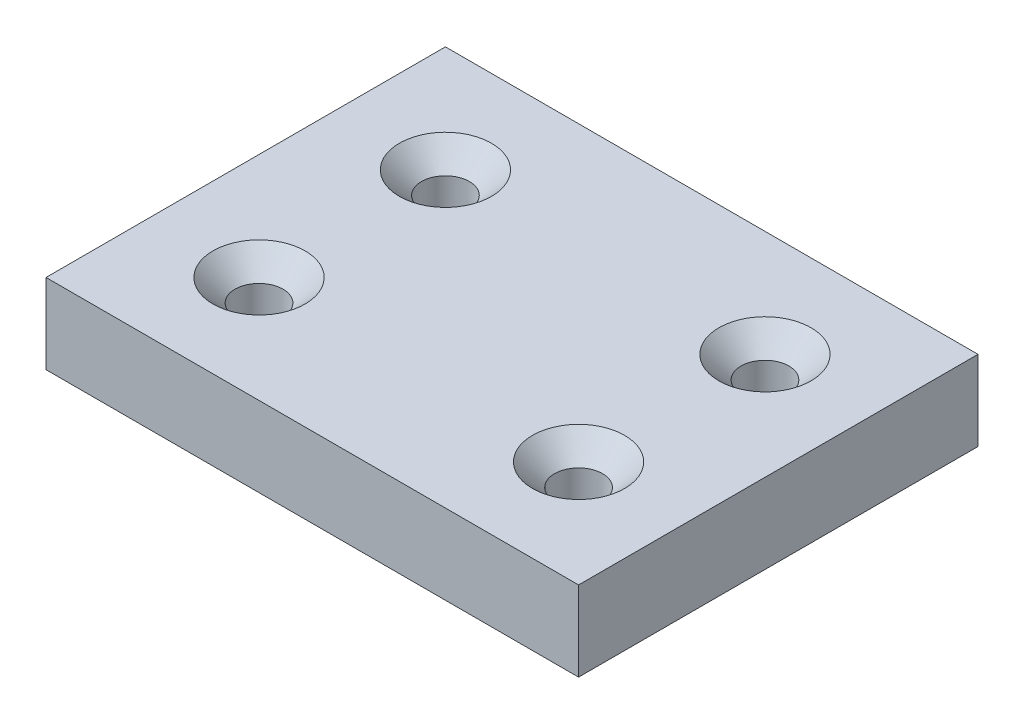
ISO-10303-21;
HEADER;
FILE_DESCRIPTION(('STEP AP214'),'2;1');
FILE_NAME('part.step','',(''),(''),'','','');
FILE_SCHEMA(('AUTOMOTIVE_DESIGN { 1 0 10303 214 1 1 1 1 }'));
ENDSEC;
DATA;
#1=APPLICATION_CONTEXT('core data for automotive mechanical design processes');
#2=APPLICATION_PROTOCOL_DEFINITION('international standard','automotive_design',2000,#1);
#3=PRODUCT_CONTEXT('',#1,'mechanical');
#4=PRODUCT('Part','Part','',(#3));
#5=PRODUCT_RELATED_PRODUCT_CATEGORY('part','',(#4));
#6=PRODUCT_DEFINITION_FORMATION('','',#4);
#7=PRODUCT_DEFINITION_CONTEXT('part definition',#1,'design');
#8=PRODUCT_DEFINITION('design','',#6,#7);
#9=PRODUCT_DEFINITION_SHAPE('','',#8);
#10=(LENGTH_UNIT() NAMED_UNIT(*) SI_UNIT(.MILLI.,.METRE.));
#11=(NAMED_UNIT(*) PLANE_ANGLE_UNIT() SI_UNIT($,.RADIAN.));
#12=(NAMED_UNIT(*) SI_UNIT($,.STERADIAN.) SOLID_ANGLE_UNIT());
#13=UNCERTAINTY_MEASURE_WITH_UNIT(LENGTH_MEASURE(1.E-05),#10,'distance_accuracy_value','');
#14=(GEOMETRIC_REPRESENTATION_CONTEXT(3) GLOBAL_UNCERTAINTY_ASSIGNED_CONTEXT((#13)) GLOBAL_UNIT_ASSIGNED_CONTEXT((#10,
#11,#12)) REPRESENTATION_CONTEXT('',''));
#15=CARTESIAN_POINT('',(0.,0.,0.));
#16=DIRECTION('',(0.,0.,1.));
#17=DIRECTION('',(1.,0.,0.));
#18=AXIS2_PLACEMENT_3D('',#15,#16,#17);
#19=CARTESIAN_POINT('',(50.,15.,37.5));
#20=DIRECTION('',(-1.,0.,0.));
#21=DIRECTION('',(0.,0.,1.));
#22=AXIS2_PLACEMENT_3D('',#19,#20,#21);
#23=PLANE('',#22);
#24=DIRECTION('',(0.,0.,-1.));
#25=VECTOR('',#24,1.);
#26=CARTESIAN_POINT('',(50.,0.,37.5));
#27=LINE('',#26,#25);
#28=CARTESIAN_POINT('',(50.,0.,37.5));
#29=VERTEX_POINT('',#28);
#30=CARTESIAN_POINT('',(50.,0.,-37.5));
#31=VERTEX_POINT('',#30);
#32=EDGE_CURVE('E97',#29,#31,#27,.T.);
#33=ORIENTED_EDGE('',*,*,#32,.T.);
#34=DIRECTION('',(0.,-1.,0.));
#35=VECTOR('',#34,1.);
#36=CARTESIAN_POINT('',(50.,15.,-37.5));
#37=LINE('',#36,#35);
#38=CARTESIAN_POINT('',(50.,15.,-37.5));
#39=VERTEX_POINT('',#38);
#40=EDGE_CURVE('E11',#39,#31,#37,.T.);
#41=ORIENTED_EDGE('',*,*,#40,.F.);
#42=DIRECTION('',(0.,0.,-1.));
#43=VECTOR('',#42,1.);
#44=CARTESIAN_POINT('',(50.,15.,37.5));
#45=LINE('',#44,#43);
#46=CARTESIAN_POINT('',(50.,15.,37.5));
#47=VERTEX_POINT('',#46);
#48=EDGE_CURVE('E85',#47,#39,#45,.T.);
#49=ORIENTED_EDGE('',*,*,#48,.F.);
#50=DIRECTION('',(0.,-1.,0.));
#51=VECTOR('',#50,1.);
#52=CARTESIAN_POINT('',(50.,15.,37.5));
#53=LINE('',#52,#51);
#54=EDGE_CURVE('E93',#47,#29,#53,.T.);
#55=ORIENTED_EDGE('',*,*,#54,.T.);
#56=EDGE_LOOP('',(#33,#41,#49,#55));
#57=FACE_BOUND('',#56,.T.);
#58=ADVANCED_FACE('F34',(#57),#23,.F.);
#59=CARTESIAN_POINT('',(-50.,15.,-37.5));
#60=DIRECTION('',(0.,0.,1.));
#61=DIRECTION('',(1.,0.,0.));
#62=AXIS2_PLACEMENT_3D('',#59,#60,#61);
#63=PLANE('',#62);
#64=DIRECTION('',(-1.,0.,0.));
#65=VECTOR('',#64,1.);
#66=CARTESIAN_POINT('',(-50.,0.,-37.5));
#67=LINE('',#66,#65);
#68=CARTESIAN_POINT('',(-50.,0.,-37.5));
#69=VERTEX_POINT('',#68);
#70=EDGE_CURVE('E89',#31,#69,#67,.T.);
#71=ORIENTED_EDGE('',*,*,#70,.T.);
#72=DIRECTION('',(0.,-1.,0.));
#73=VECTOR('',#72,1.);
#74=CARTESIAN_POINT('',(-50.,15.,-37.5));
#75=LINE('',#74,#73);
#76=CARTESIAN_POINT('',(-50.,15.,-37.5));
#77=VERTEX_POINT('',#76);
#78=EDGE_CURVE('E42',#77,#69,#75,.T.);
#79=ORIENTED_EDGE('',*,*,#78,.F.);
#80=DIRECTION('',(-1.,0.,0.));
#81=VECTOR('',#80,1.);
#82=CARTESIAN_POINT('',(-50.,15.,-37.5));
#83=LINE('',#82,#81);
#84=EDGE_CURVE('E80',#39,#77,#83,.T.);
#85=ORIENTED_EDGE('',*,*,#84,.F.);
#86=ORIENTED_EDGE('',*,*,#40,.T.);
#87=EDGE_LOOP('',(#71,#79,#85,#86));
#88=FACE_BOUND('',#87,.T.);
#89=ADVANCED_FACE('F88',(#88),#63,.F.);
#90=CARTESIAN_POINT('',(-50.,15.,37.5));
#91=DIRECTION('',(1.,0.,0.));
#92=DIRECTION('',(0.,0.,-1.));
#93=AXIS2_PLACEMENT_3D('',#90,#91,#92);
#94=PLANE('',#93);
#95=DIRECTION('',(0.,0.,1.));
#96=VECTOR('',#95,1.);
#97=CARTESIAN_POINT('',(-50.,0.,37.5));
#98=LINE('',#97,#96);
#99=CARTESIAN_POINT('',(-50.,0.,37.5));
#100=VERTEX_POINT('',#99);
#101=EDGE_CURVE('E67',#69,#100,#98,.T.);
#102=ORIENTED_EDGE('',*,*,#101,.T.);
#103=DIRECTION('',(0.,-1.,0.));
#104=VECTOR('',#103,1.);
#105=CARTESIAN_POINT('',(-50.,15.,37.5));
#106=LINE('',#105,#104);
#107=CARTESIAN_POINT('',(-50.,15.,37.5));
#108=VERTEX_POINT('',#107);
#109=EDGE_CURVE('E90',#108,#100,#106,.T.);
#110=ORIENTED_EDGE('',*,*,#109,.F.);
#111=DIRECTION('',(0.,0.,1.));
#112=VECTOR('',#111,1.);
#113=CARTESIAN_POINT('',(-50.,15.,37.5));
#114=LINE('',#113,#112);
#115=EDGE_CURVE('E83',#77,#108,#114,.T.);
#116=ORIENTED_EDGE('',*,*,#115,.F.);
#117=ORIENTED_EDGE('',*,*,#78,.T.);
#118=EDGE_LOOP('',(#102,#110,#116,#117));
#119=FACE_BOUND('',#118,.T.);
#120=ADVANCED_FACE('F91',(#119),#94,.F.);
#121=CARTESIAN_POINT('',(-50.,15.,37.5));
#122=DIRECTION('',(0.,0.,-1.));
#123=DIRECTION('',(-1.,0.,0.));
#124=AXIS2_PLACEMENT_3D('',#121,#122,#123);
#125=PLANE('',#124);
#126=DIRECTION('',(1.,0.,0.));
#127=VECTOR('',#126,1.);
#128=CARTESIAN_POINT('',(-50.,0.,37.5));
#129=LINE('',#128,#127);
#130=EDGE_CURVE('E73',#100,#29,#129,.T.);
#131=ORIENTED_EDGE('',*,*,#130,.T.);
#132=ORIENTED_EDGE('',*,*,#54,.F.);
#133=DIRECTION('',(1.,0.,0.));
#134=VECTOR('',#133,1.);
#135=CARTESIAN_POINT('',(-50.,15.,37.5));
#136=LINE('',#135,#134);
#137=EDGE_CURVE('E50',#108,#47,#136,.T.);
#138=ORIENTED_EDGE('',*,*,#137,.F.);
#139=ORIENTED_EDGE('',*,*,#109,.T.);
#140=EDGE_LOOP('',(#131,#132,#138,#139));
#141=FACE_BOUND('',#140,.T.);
#142=ADVANCED_FACE('F105',(#141),#125,.F.);
#143=CARTESIAN_POINT('',(0.,15.,0.));
#144=DIRECTION('',(0.,-1.,0.));
#145=DIRECTION('',(0.,0.,-1.));
#146=AXIS2_PLACEMENT_3D('',#143,#144,#145);
#147=PLANE('',#146);
#148=CARTESIAN_POINT('',(-30.,15.,17.5));
#149=DIRECTION('',(0.,1.,0.));
#150=DIRECTION('',(0.,0.,1.));
#151=AXIS2_PLACEMENT_3D('',#148,#149,#150);
#152=CIRCLE('',#151,8.65);
#153=CARTESIAN_POINT('',(-30.,15.,26.15));
#154=VERTEX_POINT('',#153);
#155=EDGE_CURVE('E143',#154,#154,#152,.T.);
#156=ORIENTED_EDGE('',*,*,#155,.F.);
#157=EDGE_LOOP('',(#156));
#158=FACE_BOUND('',#157,.T.);
#159=CARTESIAN_POINT('',(-30.,15.,-17.5));
#160=DIRECTION('',(0.,1.,0.));
#161=DIRECTION('',(0.,0.,1.));
#162=AXIS2_PLACEMENT_3D('',#159,#160,#161);
#163=CIRCLE('',#162,8.65);
#164=CARTESIAN_POINT('',(-30.,15.,-8.85));
#165=VERTEX_POINT('',#164);
#166=EDGE_CURVE('E134',#165,#165,#163,.T.);
#167=ORIENTED_EDGE('',*,*,#166,.F.);
#168=EDGE_LOOP('',(#167));
#169=FACE_BOUND('',#168,.T.);
#170=CARTESIAN_POINT('',(30.,15.,-17.5));
#171=DIRECTION('',(0.,1.,0.));
#172=DIRECTION('',(0.,0.,1.));
#173=AXIS2_PLACEMENT_3D('',#170,#171,#172);
#174=CIRCLE('',#173,8.65);
#175=CARTESIAN_POINT('',(30.,15.,-8.84999999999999));
#176=VERTEX_POINT('',#175);
#177=EDGE_CURVE('E125',#176,#176,#174,.T.);
#178=ORIENTED_EDGE('',*,*,#177,.F.);
#179=EDGE_LOOP('',(#178));
#180=FACE_BOUND('',#179,.T.);
#181=CARTESIAN_POINT('',(30.,15.,17.5));
#182=DIRECTION('',(0.,1.,0.));
#183=DIRECTION('',(0.,0.,1.));
#184=AXIS2_PLACEMENT_3D('',#181,#182,#183);
#185=CIRCLE('',#184,8.65);
#186=CARTESIAN_POINT('',(30.,15.,26.15));
#187=VERTEX_POINT('',#186);
#188=EDGE_CURVE('E116',#187,#187,#185,.T.);
#189=ORIENTED_EDGE('',*,*,#188,.F.);
#190=EDGE_LOOP('',(#189));
#191=FACE_BOUND('',#190,.T.);
#192=ORIENTED_EDGE('',*,*,#48,.T.);
#193=ORIENTED_EDGE('',*,*,#84,.T.);
#194=ORIENTED_EDGE('',*,*,#115,.T.);
#195=ORIENTED_EDGE('',*,*,#137,.T.);
#196=EDGE_LOOP('',(#192,#193,#194,#195));
#197=FACE_BOUND('',#196,.T.);
#198=ADVANCED_FACE('F81',(#158,#169,#180,#191,#197),#147,.F.);
#199=CARTESIAN_POINT('',(0.,0.,0.));
#200=DIRECTION('',(0.,-1.,0.));
#201=DIRECTION('',(0.,0.,-1.));
#202=AXIS2_PLACEMENT_3D('',#199,#200,#201);
#203=PLANE('',#202);
#204=CARTESIAN_POINT('',(-30.,0.,17.5));
#205=DIRECTION('',(0.,1.,0.));
#206=DIRECTION('',(0.,0.,1.));
#207=AXIS2_PLACEMENT_3D('',#204,#205,#206);
#208=CIRCLE('',#207,4.5);
#209=CARTESIAN_POINT('',(-30.,0.,22.));
#210=VERTEX_POINT('',#209);
#211=EDGE_CURVE('E137',#210,#210,#208,.T.);
#212=ORIENTED_EDGE('',*,*,#211,.T.);
#213=EDGE_LOOP('',(#212));
#214=FACE_BOUND('',#213,.T.);
#215=CARTESIAN_POINT('',(-30.,0.,-17.5));
#216=DIRECTION('',(0.,1.,0.));
#217=DIRECTION('',(0.,0.,1.));
#218=AXIS2_PLACEMENT_3D('',#215,#216,#217);
#219=CIRCLE('',#218,4.5);
#220=CARTESIAN_POINT('',(-30.,0.,-13.));
#221=VERTEX_POINT('',#220);
#222=EDGE_CURVE('E128',#221,#221,#219,.T.);
#223=ORIENTED_EDGE('',*,*,#222,.T.);
#224=EDGE_LOOP('',(#223));
#225=FACE_BOUND('',#224,.T.);
#226=CARTESIAN_POINT('',(30.,0.,-17.5));
#227=DIRECTION('',(0.,1.,0.));
#228=DIRECTION('',(0.,0.,1.));
#229=AXIS2_PLACEMENT_3D('',#226,#227,#228);
#230=CIRCLE('',#229,4.49999999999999);
#231=CARTESIAN_POINT('',(30.,0.,-13.));
#232=VERTEX_POINT('',#231);
#233=EDGE_CURVE('E119',#232,#232,#230,.T.);
#234=ORIENTED_EDGE('',*,*,#233,.T.);
#235=EDGE_LOOP('',(#234));
#236=FACE_BOUND('',#235,.T.);
#237=CARTESIAN_POINT('',(30.,0.,17.5));
#238=DIRECTION('',(0.,1.,0.));
#239=DIRECTION('',(0.,0.,1.));
#240=AXIS2_PLACEMENT_3D('',#237,#238,#239);
#241=CIRCLE('',#240,4.49999999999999);
#242=CARTESIAN_POINT('',(30.,0.,22.));
#243=VERTEX_POINT('',#242);
#244=EDGE_CURVE('E100',#243,#243,#241,.T.);
#245=ORIENTED_EDGE('',*,*,#244,.T.);
#246=EDGE_LOOP('',(#245));
#247=FACE_BOUND('',#246,.T.);
#248=ORIENTED_EDGE('',*,*,#32,.F.);
#249=ORIENTED_EDGE('',*,*,#130,.F.);
#250=ORIENTED_EDGE('',*,*,#101,.F.);
#251=ORIENTED_EDGE('',*,*,#70,.F.);
#252=EDGE_LOOP('',(#248,#249,#250,#251));
#253=FACE_BOUND('',#252,.T.);
#254=ADVANCED_FACE('F108',(#214,#225,#236,#247,#253),#203,.T.);
#255=CARTESIAN_POINT('',(30.,15.,17.5));
#256=DIRECTION('',(0.,1.,0.));
#257=DIRECTION('',(0.,0.,1.));
#258=AXIS2_PLACEMENT_3D('',#255,#256,#257);
#259=CYLINDRICAL_SURFACE('',#258,4.5);
#260=ORIENTED_EDGE('',*,*,#244,.F.);
#261=EDGE_LOOP('',(#260));
#262=FACE_BOUND('',#261,.T.);
#263=CARTESIAN_POINT('',(30.,10.85,17.5));
#264=DIRECTION('',(0.,1.,0.));
#265=DIRECTION('',(0.,0.,1.));
#266=AXIS2_PLACEMENT_3D('',#263,#264,#265);
#267=CIRCLE('',#266,4.5);
#268=CARTESIAN_POINT('',(30.,10.85,22.));
#269=VERTEX_POINT('',#268);
#270=EDGE_CURVE('E113',#269,#269,#267,.T.);
#271=ORIENTED_EDGE('',*,*,#270,.T.);
#272=EDGE_LOOP('',(#271));
#273=FACE_BOUND('',#272,.T.);
#274=ADVANCED_FACE('F161',(#262,#273),#259,.F.);
#275=CARTESIAN_POINT('',(30.,15.,17.5));
#276=DIRECTION('',(0.,1.,0.));
#277=DIRECTION('',(0.,0.,1.));
#278=AXIS2_PLACEMENT_3D('',#275,#276,#277);
#279=CONICAL_SURFACE('',#278,8.65,0.785398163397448);
#280=ORIENTED_EDGE('',*,*,#270,.F.);
#281=EDGE_LOOP('',(#280));
#282=FACE_BOUND('',#281,.T.);
#283=ORIENTED_EDGE('',*,*,#188,.T.);
#284=EDGE_LOOP('',(#283));
#285=FACE_BOUND('',#284,.T.);
#286=ADVANCED_FACE('F158',(#282,#285),#279,.F.);
#287=CARTESIAN_POINT('',(30.,15.,-17.5));
#288=DIRECTION('',(0.,1.,0.));
#289=DIRECTION('',(0.,0.,1.));
#290=AXIS2_PLACEMENT_3D('',#287,#288,#289);
#291=CYLINDRICAL_SURFACE('',#290,4.5);
#292=ORIENTED_EDGE('',*,*,#233,.F.);
#293=EDGE_LOOP('',(#292));
#294=FACE_BOUND('',#293,.T.);
#295=CARTESIAN_POINT('',(30.,10.85,-17.5));
#296=DIRECTION('',(0.,1.,0.));
#297=DIRECTION('',(0.,0.,1.));
#298=AXIS2_PLACEMENT_3D('',#295,#296,#297);
#299=CIRCLE('',#298,4.5);
#300=CARTESIAN_POINT('',(30.,10.85,-13.));
#301=VERTEX_POINT('',#300);
#302=EDGE_CURVE('E122',#301,#301,#299,.T.);
#303=ORIENTED_EDGE('',*,*,#302,.T.);
#304=EDGE_LOOP('',(#303));
#305=FACE_BOUND('',#304,.T.);
#306=ADVANCED_FACE('F160',(#294,#305),#291,.F.);
#307=CARTESIAN_POINT('',(30.,15.,-17.5));
#308=DIRECTION('',(0.,1.,0.));
#309=DIRECTION('',(0.,0.,1.));
#310=AXIS2_PLACEMENT_3D('',#307,#308,#309);
#311=CONICAL_SURFACE('',#310,8.65,0.785398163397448);
#312=ORIENTED_EDGE('',*,*,#302,.F.);
#313=EDGE_LOOP('',(#312));
#314=FACE_BOUND('',#313,.T.);
#315=ORIENTED_EDGE('',*,*,#177,.T.);
#316=EDGE_LOOP('',(#315));
#317=FACE_BOUND('',#316,.T.);
#318=ADVANCED_FACE('F168',(#314,#317),#311,.F.);
#319=CARTESIAN_POINT('',(-30.,15.,-17.5));
#320=DIRECTION('',(0.,1.,0.));
#321=DIRECTION('',(0.,0.,1.));
#322=AXIS2_PLACEMENT_3D('',#319,#320,#321);
#323=CYLINDRICAL_SURFACE('',#322,4.5);
#324=ORIENTED_EDGE('',*,*,#222,.F.);
#325=EDGE_LOOP('',(#324));
#326=FACE_BOUND('',#325,.T.);
#327=CARTESIAN_POINT('',(-30.,10.85,-17.5));
#328=DIRECTION('',(0.,1.,0.));
#329=DIRECTION('',(0.,0.,1.));
#330=AXIS2_PLACEMENT_3D('',#327,#328,#329);
#331=CIRCLE('',#330,4.5);
#332=CARTESIAN_POINT('',(-30.,10.85,-13.));
#333=VERTEX_POINT('',#332);
#334=EDGE_CURVE('E131',#333,#333,#331,.T.);
#335=ORIENTED_EDGE('',*,*,#334,.T.);
#336=EDGE_LOOP('',(#335));
#337=FACE_BOUND('',#336,.T.);
#338=ADVANCED_FACE('F202',(#326,#337),#323,.F.);
#339=CARTESIAN_POINT('',(-30.,15.,-17.5));
#340=DIRECTION('',(0.,1.,0.));
#341=DIRECTION('',(0.,0.,1.));
#342=AXIS2_PLACEMENT_3D('',#339,#340,#341);
#343=CONICAL_SURFACE('',#342,8.65,0.785398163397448);
#344=ORIENTED_EDGE('',*,*,#334,.F.);
#345=EDGE_LOOP('',(#344));
#346=FACE_BOUND('',#345,.T.);
#347=ORIENTED_EDGE('',*,*,#166,.T.);
#348=EDGE_LOOP('',(#347));
#349=FACE_BOUND('',#348,.T.);
#350=ADVANCED_FACE('F207',(#346,#349),#343,.F.);
#351=CARTESIAN_POINT('',(-30.,15.,17.5));
#352=DIRECTION('',(0.,1.,0.));
#353=DIRECTION('',(0.,0.,1.));
#354=AXIS2_PLACEMENT_3D('',#351,#352,#353);
#355=CYLINDRICAL_SURFACE('',#354,4.5);
#356=ORIENTED_EDGE('',*,*,#211,.F.);
#357=EDGE_LOOP('',(#356));
#358=FACE_BOUND('',#357,.T.);
#359=CARTESIAN_POINT('',(-30.,10.85,17.5));
#360=DIRECTION('',(0.,1.,0.));
#361=DIRECTION('',(0.,0.,1.));
#362=AXIS2_PLACEMENT_3D('',#359,#360,#361);
#363=CIRCLE('',#362,4.5);
#364=CARTESIAN_POINT('',(-30.,10.85,22.));
#365=VERTEX_POINT('',#364);
#366=EDGE_CURVE('E140',#365,#365,#363,.T.);
#367=ORIENTED_EDGE('',*,*,#366,.T.);
#368=EDGE_LOOP('',(#367));
#369=FACE_BOUND('',#368,.T.);
#370=ADVANCED_FACE('F213',(#358,#369),#355,.F.);
#371=CARTESIAN_POINT('',(-30.,15.,17.5));
#372=DIRECTION('',(0.,1.,0.));
#373=DIRECTION('',(0.,0.,1.));
#374=AXIS2_PLACEMENT_3D('',#371,#372,#373);
#375=CONICAL_SURFACE('',#374,8.65,0.785398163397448);
#376=ORIENTED_EDGE('',*,*,#366,.F.);
#377=EDGE_LOOP('',(#376));
#378=FACE_BOUND('',#377,.T.);
#379=ORIENTED_EDGE('',*,*,#155,.T.);
#380=EDGE_LOOP('',(#379));
#381=FACE_BOUND('',#380,.T.);
#382=ADVANCED_FACE('F147',(#378,#381),#375,.F.);
#383=CLOSED_SHELL('',(#58,#89,#120,#142,#198,#254,#274,#286,#306,#318,#338,#350,#370,#382));
#384=MANIFOLD_SOLID_BREP('B2',#383);
#385=ADVANCED_BREP_SHAPE_REPRESENTATION('',(#18,#384),#14);
#386=SHAPE_DEFINITION_REPRESENTATION(#9,#385);
ENDSEC;
END-ISO-10303-21;
